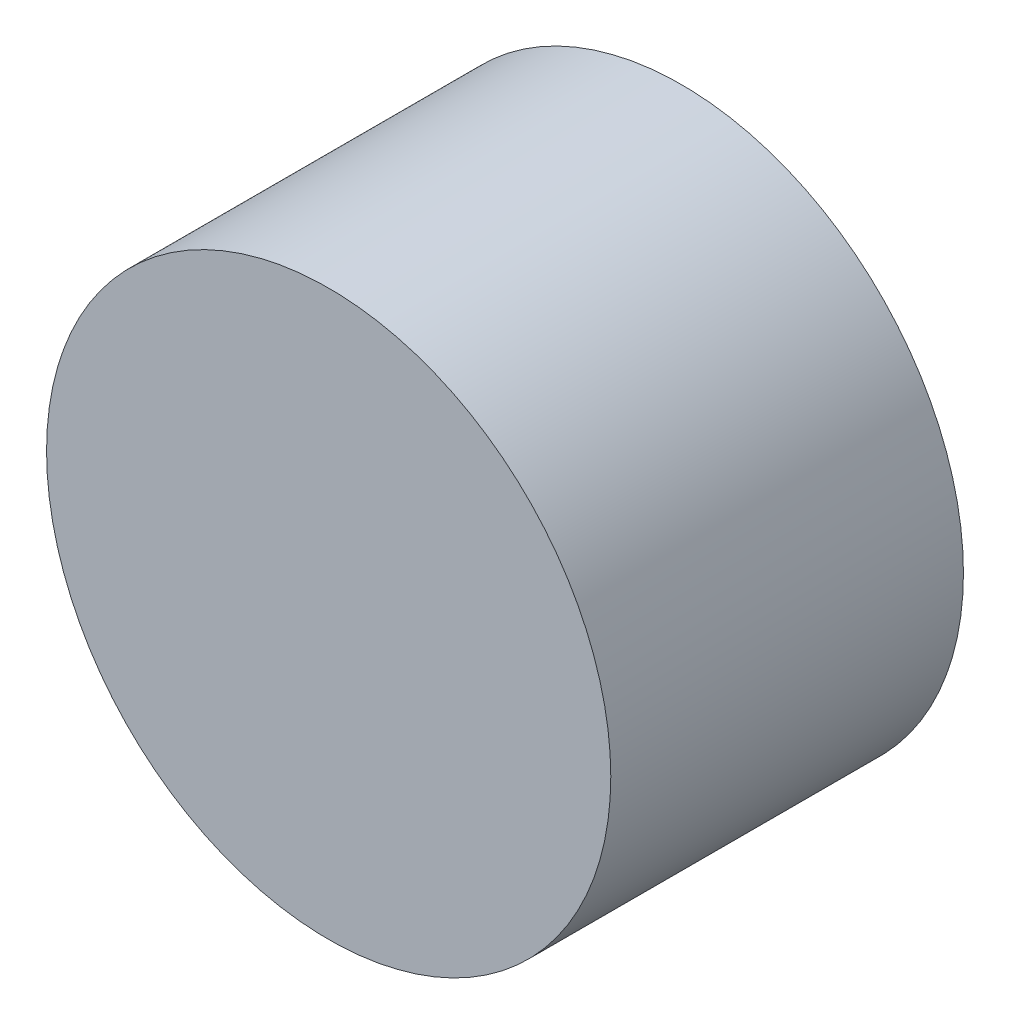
ISO-10303-21;
HEADER;
FILE_DESCRIPTION(('STEP AP214'),'2;1');
FILE_NAME('part.step','',(''),(''),'','','');
FILE_SCHEMA(('AUTOMOTIVE_DESIGN { 1 0 10303 214 1 1 1 1 }'));
ENDSEC;
DATA;
#1=APPLICATION_CONTEXT('core data for automotive mechanical design processes');
#2=APPLICATION_PROTOCOL_DEFINITION('international standard','automotive_design',2000,#1);
#3=PRODUCT_CONTEXT('',#1,'mechanical');
#4=PRODUCT('Part','Part','',(#3));
#5=PRODUCT_RELATED_PRODUCT_CATEGORY('part','',(#4));
#6=PRODUCT_DEFINITION_FORMATION('','',#4);
#7=PRODUCT_DEFINITION_CONTEXT('part definition',#1,'design');
#8=PRODUCT_DEFINITION('design','',#6,#7);
#9=PRODUCT_DEFINITION_SHAPE('','',#8);
#10=(LENGTH_UNIT() NAMED_UNIT(*) SI_UNIT(.MILLI.,.METRE.));
#11=(NAMED_UNIT(*) PLANE_ANGLE_UNIT() SI_UNIT($,.RADIAN.));
#12=(NAMED_UNIT(*) SI_UNIT($,.STERADIAN.) SOLID_ANGLE_UNIT());
#13=UNCERTAINTY_MEASURE_WITH_UNIT(LENGTH_MEASURE(1.E-05),#10,'distance_accuracy_value','');
#14=(GEOMETRIC_REPRESENTATION_CONTEXT(3) GLOBAL_UNCERTAINTY_ASSIGNED_CONTEXT((#13)) GLOBAL_UNIT_ASSIGNED_CONTEXT((#10,
#11,#12)) REPRESENTATION_CONTEXT('',''));
#15=CARTESIAN_POINT('',(0.,0.,0.));
#16=DIRECTION('',(0.,0.,1.));
#17=DIRECTION('',(1.,0.,0.));
#18=AXIS2_PLACEMENT_3D('',#15,#16,#17);
#19=CARTESIAN_POINT('',(0.,0.,30.));
#20=DIRECTION('',(0.,0.,1.));
#21=DIRECTION('',(1.,0.,0.));
#22=AXIS2_PLACEMENT_3D('',#19,#20,#21);
#23=CYLINDRICAL_SURFACE('',#22,8.);
#24=CARTESIAN_POINT('',(0.,0.,10.));
#25=DIRECTION('',(0.,0.,1.));
#26=DIRECTION('',(1.,0.,0.));
#27=AXIS2_PLACEMENT_3D('',#24,#25,#26);
#28=CIRCLE('',#27,8.);
#29=CARTESIAN_POINT('',(8.,0.,10.));
#30=VERTEX_POINT('',#29);
#31=EDGE_CURVE('E8',#30,#30,#28,.T.);
#32=ORIENTED_EDGE('',*,*,#31,.F.);
#33=EDGE_LOOP('',(#32));
#34=FACE_BOUND('',#33,.T.);
#35=CARTESIAN_POINT('',(0.,0.,0.));
#36=DIRECTION('',(0.,0.,1.));
#37=DIRECTION('',(1.,0.,0.));
#38=AXIS2_PLACEMENT_3D('',#35,#36,#37);
#39=CIRCLE('',#38,8.);
#40=CARTESIAN_POINT('',(8.,0.,0.));
#41=VERTEX_POINT('',#40);
#42=EDGE_CURVE('E27',#41,#41,#39,.T.);
#43=ORIENTED_EDGE('',*,*,#42,.T.);
#44=EDGE_LOOP('',(#43));
#45=FACE_BOUND('',#44,.T.);
#46=ADVANCED_FACE('F13',(#34,#45),#23,.T.);
#47=CARTESIAN_POINT('',(8.,0.,10.));
#48=DIRECTION('',(0.,0.,-1.));
#49=DIRECTION('',(-1.,0.,0.));
#50=AXIS2_PLACEMENT_3D('',#47,#48,#49);
#51=PLANE('',#50);
#52=ORIENTED_EDGE('',*,*,#31,.T.);
#53=EDGE_LOOP('',(#52));
#54=FACE_BOUND('',#53,.T.);
#55=ADVANCED_FACE('F49',(#54),#51,.F.);
#56=CARTESIAN_POINT('',(0.,0.,5.));
#57=DIRECTION('',(0.,0.,1.));
#58=DIRECTION('',(1.,0.,0.));
#59=AXIS2_PLACEMENT_3D('',#56,#57,#58);
#60=PLANE('',#59);
#61=CARTESIAN_POINT('',(0.,0.,5.));
#62=DIRECTION('',(0.,0.,1.));
#63=DIRECTION('',(1.,0.,0.));
#64=AXIS2_PLACEMENT_3D('',#61,#62,#63);
#65=CIRCLE('',#64,3.);
#66=CARTESIAN_POINT('',(3.,0.,5.));
#67=VERTEX_POINT('',#66);
#68=EDGE_CURVE('E19',#67,#67,#65,.T.);
#69=ORIENTED_EDGE('',*,*,#68,.F.);
#70=EDGE_LOOP('',(#69));
#71=FACE_BOUND('',#70,.T.);
#72=ADVANCED_FACE('F42',(#71),#60,.F.);
#73=CARTESIAN_POINT('',(0.,0.,30.));
#74=DIRECTION('',(0.,0.,1.));
#75=DIRECTION('',(1.,0.,0.));
#76=AXIS2_PLACEMENT_3D('',#73,#74,#75);
#77=CYLINDRICAL_SURFACE('',#76,3.);
#78=CARTESIAN_POINT('',(0.,0.,0.));
#79=DIRECTION('',(0.,0.,1.));
#80=DIRECTION('',(1.,0.,0.));
#81=AXIS2_PLACEMENT_3D('',#78,#79,#80);
#82=CIRCLE('',#81,3.);
#83=CARTESIAN_POINT('',(3.,0.,0.));
#84=VERTEX_POINT('',#83);
#85=EDGE_CURVE('E23',#84,#84,#82,.T.);
#86=ORIENTED_EDGE('',*,*,#85,.F.);
#87=EDGE_LOOP('',(#86));
#88=FACE_BOUND('',#87,.T.);
#89=ORIENTED_EDGE('',*,*,#68,.T.);
#90=EDGE_LOOP('',(#89));
#91=FACE_BOUND('',#90,.T.);
#92=ADVANCED_FACE('F37',(#88,#91),#77,.F.);
#93=CARTESIAN_POINT('',(3.,0.,0.));
#94=DIRECTION('',(0.,0.,1.));
#95=DIRECTION('',(1.,0.,0.));
#96=AXIS2_PLACEMENT_3D('',#93,#94,#95);
#97=PLANE('',#96);
#98=ORIENTED_EDGE('',*,*,#42,.F.);
#99=EDGE_LOOP('',(#98));
#100=FACE_BOUND('',#99,.T.);
#101=ORIENTED_EDGE('',*,*,#85,.T.);
#102=EDGE_LOOP('',(#101));
#103=FACE_BOUND('',#102,.T.);
#104=ADVANCED_FACE('F34',(#100,#103),#97,.F.);
#105=CLOSED_SHELL('',(#46,#55,#72,#92,#104));
#106=MANIFOLD_SOLID_BREP('B1',#105);
#107=ADVANCED_BREP_SHAPE_REPRESENTATION('',(#18,#106),#14);
#108=SHAPE_DEFINITION_REPRESENTATION(#9,#107);
ENDSEC;
END-ISO-10303-21;
